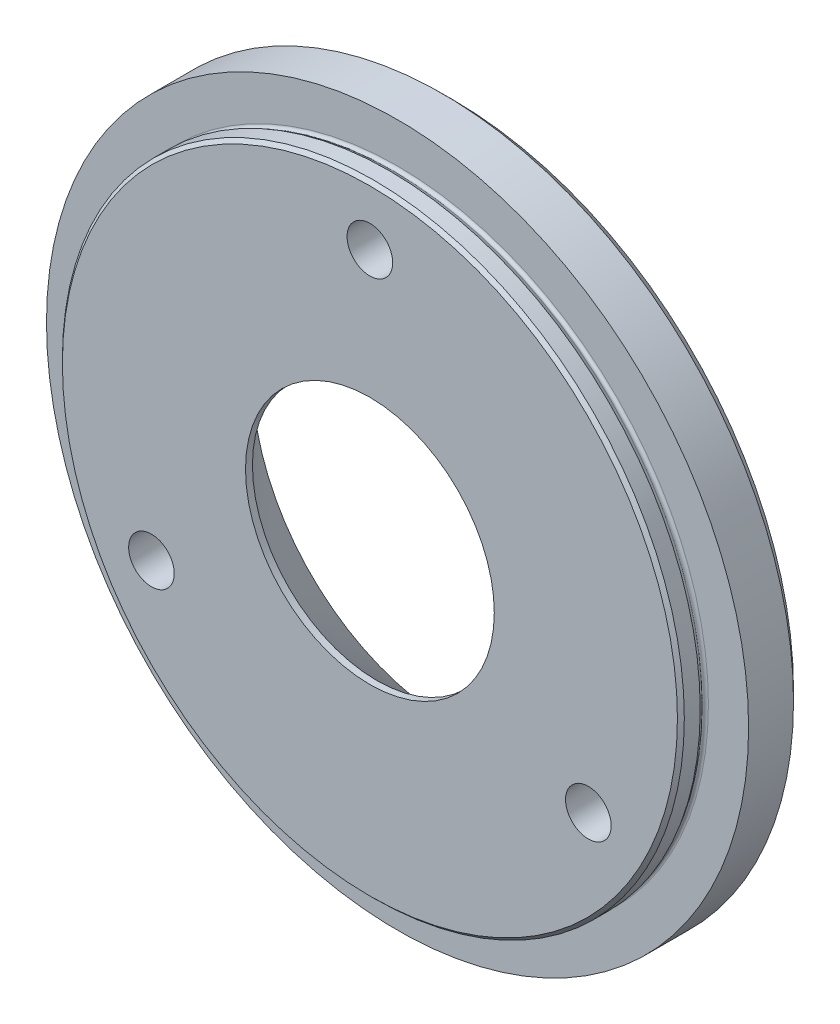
from build123d import *

# Parameters (mm, degrees)
CBORE_FOR_M6_HEX_SOCKET_HEAD_CAP_SCREW1_D           = 6.6
CBORE_FOR_M6_HEX_SOCKET_HEAD_CAP_SCREW1_CBORE_D     = 11
CBORE_FOR_M6_HEX_SOCKET_HEAD_CAP_SCREW1_CBORE_DEPTH = 7


with BuildPart() as part:
    # Sketch1 → Revolve1 (revolve)
    with BuildSketch(Plane(origin=(0, -18, -1.35), x_dir=(0, 0, -1), z_dir=(1, 0, 0)), mode=Mode.PRIVATE) as revolve1_sk:
        Polygon((-5.35, 36), (-4.35, 36), (6.65, 47), (6.65, 63), (-4.85, 63), (-5.35, 62.5), align=None)
    revolve(revolve1_sk.sketch.rotate(Axis((0, 0, 4), (0, 0, -1)), 90), axis=Axis((0, 0, 4), (0, 0, -1)))

    # Sketch2 → Revolve2 (revolve)
    with BuildSketch(Plane(origin=(0, 0, 0), x_dir=(0, 0, -1), z_dir=(1, 0, 0)), mode=Mode.PRIVATE) as revolve2_sk:
        Polygon((6.5, 50.8), (8, 49.3), (8, 45), (0, 45), (0, 50.8), align=None)
    revolve(revolve2_sk.sketch.rotate(Axis((0, 0, 4), (0, 0, -1)), 90), axis=Axis((0, 0, 4), (0, 0, -1)))

    # Sketch3 → Cut-Revolve1 (revolve, cut)
    with BuildSketch(Plane(origin=(0, 0, 0), x_dir=(0, 0, -1), z_dir=(1, 0, 0)), mode=Mode.PRIVATE) as cut_revolve1_sk:
        with BuildLine():
            Line((-1.2, 45), (0, 45))
            Line((0, 45), (0, 44.985964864))
            ThreePointArc((0, 44.985964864), (-0.203030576, 44.637822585), (-0.60601523, 44.643097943))
            Line((-0.60601523, 44.643097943), (-1.2, 45))
        make_face()
    revolve(cut_revolve1_sk.sketch.rotate(Axis((0, 0, 4), (0, 0, -1)), 90), axis=Axis((0, 0, 4), (0, 0, -1)), mode=Mode.SUBTRACT)

    # CBORE for M6 Hex Socket Head Cap Screw1 (through all)
    with Locations(Plane(origin=(0, 0, -8), x_dir=(-1, 0, 0), z_dir=(0, 0, -1))):
        with Locations((0, 36.5), (31.609927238, -18.25), (-31.609927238, -18.25)):
            CounterBoreHole(CBORE_FOR_M6_HEX_SOCKET_HEAD_CAP_SCREW1_D / 2, CBORE_FOR_M6_HEX_SOCKET_HEAD_CAP_SCREW1_CBORE_D / 2, CBORE_FOR_M6_HEX_SOCKET_HEAD_CAP_SCREW1_CBORE_DEPTH)


solid = part.part
